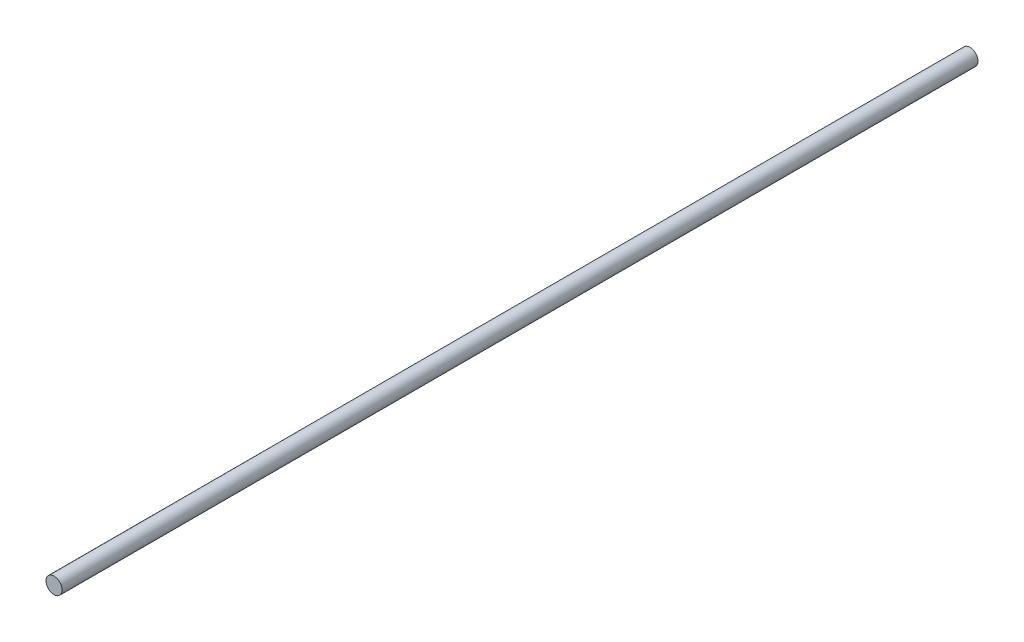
from build123d import *

# Parameters (mm, degrees)
ESQUISSE1_R        = 3
BOSS_EXTRU_1_DEPTH = 340.5


with BuildPart() as part:
    # Esquisse1 → Boss.-Extru.1 (new body)
    with BuildSketch(Plane.XY):
        Circle(ESQUISSE1_R)
    extrude(amount=BOSS_EXTRU_1_DEPTH)


solid = part.part
